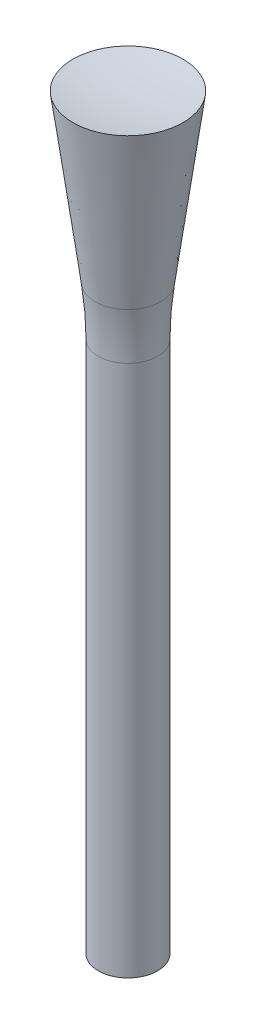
ISO-10303-21;
HEADER;
FILE_DESCRIPTION(('STEP AP214'),'2;1');
FILE_NAME('part.step','',(''),(''),'','','');
FILE_SCHEMA(('AUTOMOTIVE_DESIGN { 1 0 10303 214 1 1 1 1 }'));
ENDSEC;
DATA;
#1=APPLICATION_CONTEXT('core data for automotive mechanical design processes');
#2=APPLICATION_PROTOCOL_DEFINITION('international standard','automotive_design',2000,#1);
#3=PRODUCT_CONTEXT('',#1,'mechanical');
#4=PRODUCT('Part','Part','',(#3));
#5=PRODUCT_RELATED_PRODUCT_CATEGORY('part','',(#4));
#6=PRODUCT_DEFINITION_FORMATION('','',#4);
#7=PRODUCT_DEFINITION_CONTEXT('part definition',#1,'design');
#8=PRODUCT_DEFINITION('design','',#6,#7);
#9=PRODUCT_DEFINITION_SHAPE('','',#8);
#10=(LENGTH_UNIT() NAMED_UNIT(*) SI_UNIT(.MILLI.,.METRE.));
#11=(NAMED_UNIT(*) PLANE_ANGLE_UNIT() SI_UNIT($,.RADIAN.));
#12=(NAMED_UNIT(*) SI_UNIT($,.STERADIAN.) SOLID_ANGLE_UNIT());
#13=UNCERTAINTY_MEASURE_WITH_UNIT(LENGTH_MEASURE(1.E-05),#10,'distance_accuracy_value','');
#14=(GEOMETRIC_REPRESENTATION_CONTEXT(3) GLOBAL_UNCERTAINTY_ASSIGNED_CONTEXT((#13)) GLOBAL_UNIT_ASSIGNED_CONTEXT((#10,
#11,#12)) REPRESENTATION_CONTEXT('',''));
#15=CARTESIAN_POINT('',(0.,0.,0.));
#16=DIRECTION('',(0.,0.,1.));
#17=DIRECTION('',(1.,0.,0.));
#18=AXIS2_PLACEMENT_3D('',#15,#16,#17);
#19=CARTESIAN_POINT('',(0.,42.67,0.));
#20=DIRECTION('',(0.,1.,0.));
#21=DIRECTION('',(-1.,0.,0.));
#22=AXIS2_PLACEMENT_3D('',#19,#20,#21);
#23=SPHERICAL_SURFACE('',#22,42.67);
#24=CARTESIAN_POINT('',(0.,0.648253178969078,0.));
#25=DIRECTION('',(0.,1.,0.));
#26=DIRECTION('',(-1.,0.,0.));
#27=AXIS2_PLACEMENT_3D('',#24,#25,#26);
#28=CIRCLE('',#27,7.40956774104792);
#29=CARTESIAN_POINT('',(-7.40956774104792,0.648253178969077,0.));
#30=VERTEX_POINT('',#29);
#31=EDGE_CURVE('E47',#30,#30,#28,.T.);
#32=ORIENTED_EDGE('',*,*,#31,.T.);
#33=EDGE_LOOP('',(#32));
#34=FACE_BOUND('',#33,.T.);
#35=ADVANCED_FACE('F32',(#34),#23,.F.);
#36=CARTESIAN_POINT('',(-3.99999999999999,-100.,0.));
#37=DIRECTION('',(0.,-1.,0.));
#38=DIRECTION('',(1.,0.,0.));
#39=AXIS2_PLACEMENT_3D('',#36,#37,#38);
#40=PLANE('',#39);
#41=CARTESIAN_POINT('',(0.,-100.,0.));
#42=DIRECTION('',(0.,1.,0.));
#43=DIRECTION('',(-1.,0.,0.));
#44=AXIS2_PLACEMENT_3D('',#41,#42,#43);
#45=CIRCLE('',#44,4.);
#46=CARTESIAN_POINT('',(-3.99999999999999,-100.,0.));
#47=VERTEX_POINT('',#46);
#48=EDGE_CURVE('E43',#47,#47,#45,.T.);
#49=ORIENTED_EDGE('',*,*,#48,.F.);
#50=EDGE_LOOP('',(#49));
#51=FACE_BOUND('',#50,.T.);
#52=ADVANCED_FACE('F63',(#51),#40,.T.);
#53=CARTESIAN_POINT('',(0.,0.,0.));
#54=DIRECTION('',(0.,1.,0.));
#55=DIRECTION('',(-1.,0.,0.));
#56=AXIS2_PLACEMENT_3D('',#53,#54,#55);
#57=CYLINDRICAL_SURFACE('',#56,4.);
#58=CARTESIAN_POINT('',(0.,-28.3088374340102,0.));
#59=DIRECTION('',(0.,1.,0.));
#60=DIRECTION('',(-1.,0.,0.));
#61=AXIS2_PLACEMENT_3D('',#58,#59,#60);
#62=CIRCLE('',#61,4.);
#63=CARTESIAN_POINT('',(-4.,-28.3088374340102,0.));
#64=VERTEX_POINT('',#63);
#65=EDGE_CURVE('E10',#64,#64,#62,.F.);
#66=ORIENTED_EDGE('',*,*,#65,.T.);
#67=EDGE_LOOP('',(#66));
#68=FACE_BOUND('',#67,.T.);
#69=ORIENTED_EDGE('',*,*,#48,.T.);
#70=EDGE_LOOP('',(#69));
#71=FACE_BOUND('',#70,.T.);
#72=ADVANCED_FACE('F56',(#68,#71),#57,.T.);
#73=CARTESIAN_POINT('',(0.,0.648253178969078,0.));
#74=DIRECTION('',(0.,1.,0.));
#75=DIRECTION('',(-1.,0.,0.));
#76=AXIS2_PLACEMENT_3D('',#73,#74,#75);
#77=CONICAL_SURFACE('',#76,7.40956774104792,0.132160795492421);
#78=CARTESIAN_POINT('',(0.,-21.7200173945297,0.));
#79=DIRECTION('',(0.,1.,0.));
#80=DIRECTION('',(-1.,0.,0.));
#81=AXIS2_PLACEMENT_3D('',#78,#79,#80);
#82=CIRCLE('',#81,4.43602668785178);
#83=CARTESIAN_POINT('',(-4.43602668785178,-21.7200173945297,0.));
#84=VERTEX_POINT('',#83);
#85=EDGE_CURVE('E39',#84,#84,#82,.T.);
#86=ORIENTED_EDGE('',*,*,#85,.T.);
#87=EDGE_LOOP('',(#86));
#88=FACE_BOUND('',#87,.T.);
#89=ORIENTED_EDGE('',*,*,#31,.F.);
#90=EDGE_LOOP('',(#89));
#91=FACE_BOUND('',#90,.T.);
#92=ADVANCED_FACE('F54',(#88,#91),#77,.T.);
#93=CARTESIAN_POINT('',(0.,-28.3088374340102,0.));
#94=DIRECTION('',(0.,1.,0.));
#95=DIRECTION('',(-1.,0.,0.));
#96=AXIS2_PLACEMENT_3D('',#93,#94,#95);
#97=TOROIDAL_SURFACE('',#96,54.,50.);
#98=ORIENTED_EDGE('',*,*,#65,.F.);
#99=EDGE_LOOP('',(#98));
#100=FACE_BOUND('',#99,.T.);
#101=ORIENTED_EDGE('',*,*,#85,.F.);
#102=EDGE_LOOP('',(#101));
#103=FACE_BOUND('',#102,.T.);
#104=ADVANCED_FACE('F34',(#100,#103),#97,.F.);
#105=CLOSED_SHELL('',(#35,#52,#72,#92,#104));
#106=MANIFOLD_SOLID_BREP('B2',#105);
#107=ADVANCED_BREP_SHAPE_REPRESENTATION('',(#18,#106),#14);
#108=SHAPE_DEFINITION_REPRESENTATION(#9,#107);
ENDSEC;
END-ISO-10303-21;
